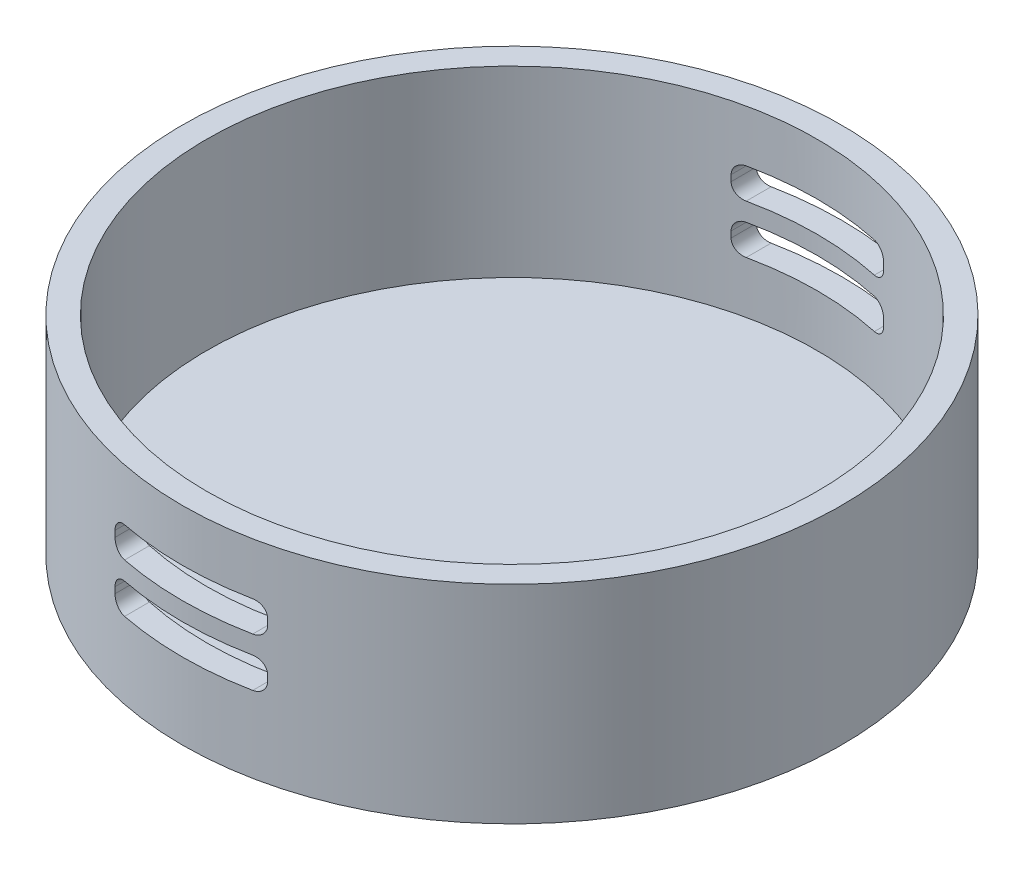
from build123d import *

# Parameters (mm, degrees)
SKETCH14_R          = 50
BOSS_EXTRUDE1_DEPTH = 30
SHELL2_T            = 4
CUT_EXTRUDE3_DEPTH  = 18


with BuildPart() as part:
    # Sketch14 → Boss-Extrude1 (new body)
    with BuildSketch(Plane(origin=(0, 0, 0), x_dir=(1, 0, 0), z_dir=(0, 1, 0))):
        with Locations(Location((0, 0, 0), (0, 0, 270))):
            Circle(SKETCH14_R)
    extrude(amount=BOSS_EXTRUDE1_DEPTH)

    # Shell2
    shell2_openings = [part.faces().sort_by_distance(p)[0] for p in [
        (0, 30, 0),
    ]]
    offset(amount=SHELL2_T, openings=shell2_openings, kind=Kind.INTERSECTION)

    # Sketch21 → Cut-Extrude3 (cut, symmetric)
    with BuildSketch(Plane(origin=(0, 0, -50), x_dir=(-1, 0, 0), z_dir=(0, 0, -1))):
        with BuildLine():
            Line((-10.5, 21.5), (10.5, 21.5))
            ThreePointArc((10.5, 21.5), (11.914213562, 20.914213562), (12.5, 19.5))
            Line((12.5, 19.5), (12.5, 18.5))
            ThreePointArc((12.5, 18.5), (11.914213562, 17.085786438), (10.5, 16.5))
            Line((10.5, 16.5), (-10.5, 16.5))
            ThreePointArc((-10.5, 16.5), (-11.914213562, 17.085786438), (-12.5, 18.5))
            Line((-12.5, 18.5), (-12.5, 19.5))
            ThreePointArc((-12.5, 19.5), (-11.914213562, 20.914213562), (-10.5, 21.5))
        make_face()
        with BuildLine():
            Line((12.5, 10.5), (12.5, 11.5))
            ThreePointArc((12.5, 11.5), (11.914213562, 12.914213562), (10.5, 13.5))
            Line((10.5, 13.5), (-10.5, 13.5))
            ThreePointArc((-10.5, 13.5), (-11.914213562, 12.914213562), (-12.5, 11.5))
            Line((-12.5, 11.5), (-12.5, 10.5))
            ThreePointArc((-12.5, 10.5), (-11.914213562, 9.085786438), (-10.5, 8.5))
            Line((-10.5, 8.5), (10.5, 8.5))
            ThreePointArc((10.5, 8.5), (11.914213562, 9.085786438), (12.5, 10.5))
        make_face()
    cut_extrude3 = extrude(amount=CUT_EXTRUDE3_DEPTH, both=True, mode=Mode.SUBTRACT)

    # Mirror4: Cut-Extrude3 across plane
    add(cut_extrude3.mirror(Plane.XY), mode=Mode.SUBTRACT)


solid = part.part
